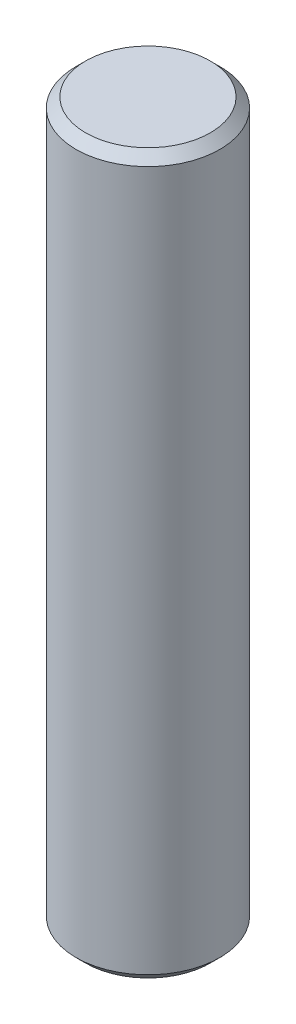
ISO-10303-21;
HEADER;
FILE_DESCRIPTION(('STEP AP214'),'2;1');
FILE_NAME('part.step','',(''),(''),'','','');
FILE_SCHEMA(('AUTOMOTIVE_DESIGN { 1 0 10303 214 1 1 1 1 }'));
ENDSEC;
DATA;
#1=APPLICATION_CONTEXT('core data for automotive mechanical design processes');
#2=APPLICATION_PROTOCOL_DEFINITION('international standard','automotive_design',2000,#1);
#3=PRODUCT_CONTEXT('',#1,'mechanical');
#4=PRODUCT('Part','Part','',(#3));
#5=PRODUCT_RELATED_PRODUCT_CATEGORY('part','',(#4));
#6=PRODUCT_DEFINITION_FORMATION('','',#4);
#7=PRODUCT_DEFINITION_CONTEXT('part definition',#1,'design');
#8=PRODUCT_DEFINITION('design','',#6,#7);
#9=PRODUCT_DEFINITION_SHAPE('','',#8);
#10=(LENGTH_UNIT() NAMED_UNIT(*) SI_UNIT(.MILLI.,.METRE.));
#11=(NAMED_UNIT(*) PLANE_ANGLE_UNIT() SI_UNIT($,.RADIAN.));
#12=(NAMED_UNIT(*) SI_UNIT($,.STERADIAN.) SOLID_ANGLE_UNIT());
#13=UNCERTAINTY_MEASURE_WITH_UNIT(LENGTH_MEASURE(1.E-05),#10,'distance_accuracy_value','');
#14=(GEOMETRIC_REPRESENTATION_CONTEXT(3) GLOBAL_UNCERTAINTY_ASSIGNED_CONTEXT((#13)) GLOBAL_UNIT_ASSIGNED_CONTEXT((#10,
#11,#12)) REPRESENTATION_CONTEXT('',''));
#15=CARTESIAN_POINT('',(0.,0.,0.));
#16=DIRECTION('',(0.,0.,1.));
#17=DIRECTION('',(1.,0.,0.));
#18=AXIS2_PLACEMENT_3D('',#15,#16,#17);
#19=CARTESIAN_POINT('',(0.,15.,0.));
#20=DIRECTION('',(0.,-1.,0.));
#21=DIRECTION('',(0.,0.,-1.));
#22=AXIS2_PLACEMENT_3D('',#19,#20,#21);
#23=CYLINDRICAL_SURFACE('',#22,1.5);
#24=CARTESIAN_POINT('',(0.,0.199999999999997,0.));
#25=DIRECTION('',(0.,1.,0.));
#26=DIRECTION('',(0.,0.,1.));
#27=AXIS2_PLACEMENT_3D('',#24,#25,#26);
#28=CIRCLE('',#27,1.5);
#29=CARTESIAN_POINT('',(0.,0.199999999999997,1.5));
#30=VERTEX_POINT('',#29);
#31=EDGE_CURVE('E41',#30,#30,#28,.T.);
#32=ORIENTED_EDGE('',*,*,#31,.T.);
#33=EDGE_LOOP('',(#32));
#34=FACE_BOUND('',#33,.T.);
#35=CARTESIAN_POINT('',(0.,14.8,0.));
#36=DIRECTION('',(0.,1.,0.));
#37=DIRECTION('',(0.,0.,1.));
#38=AXIS2_PLACEMENT_3D('',#35,#36,#37);
#39=CIRCLE('',#38,1.5);
#40=CARTESIAN_POINT('',(0.,14.8,1.5));
#41=VERTEX_POINT('',#40);
#42=EDGE_CURVE('E45',#41,#41,#39,.F.);
#43=ORIENTED_EDGE('',*,*,#42,.T.);
#44=EDGE_LOOP('',(#43));
#45=FACE_BOUND('',#44,.T.);
#46=ADVANCED_FACE('F30',(#34,#45),#23,.T.);
#47=CARTESIAN_POINT('',(0.,15.,0.));
#48=DIRECTION('',(0.,1.,0.));
#49=DIRECTION('',(0.,0.,1.));
#50=AXIS2_PLACEMENT_3D('',#47,#48,#49);
#51=PLANE('',#50);
#52=CARTESIAN_POINT('',(0.,15.,0.));
#53=DIRECTION('',(0.,1.,0.));
#54=DIRECTION('',(0.,0.,1.));
#55=AXIS2_PLACEMENT_3D('',#52,#53,#54);
#56=CIRCLE('',#55,1.3);
#57=CARTESIAN_POINT('',(0.,15.,1.3));
#58=VERTEX_POINT('',#57);
#59=EDGE_CURVE('E10',#58,#58,#56,.T.);
#60=ORIENTED_EDGE('',*,*,#59,.T.);
#61=EDGE_LOOP('',(#60));
#62=FACE_BOUND('',#61,.T.);
#63=ADVANCED_FACE('F61',(#62),#51,.T.);
#64=CARTESIAN_POINT('',(0.,0.,0.));
#65=DIRECTION('',(0.,1.,0.));
#66=DIRECTION('',(0.,0.,1.));
#67=AXIS2_PLACEMENT_3D('',#64,#65,#66);
#68=PLANE('',#67);
#69=CARTESIAN_POINT('',(0.,0.,0.));
#70=DIRECTION('',(0.,1.,0.));
#71=DIRECTION('',(0.,0.,1.));
#72=AXIS2_PLACEMENT_3D('',#69,#70,#71);
#73=CIRCLE('',#72,1.3);
#74=CARTESIAN_POINT('',(0.,0.,1.3));
#75=VERTEX_POINT('',#74);
#76=EDGE_CURVE('E37',#75,#75,#73,.F.);
#77=ORIENTED_EDGE('',*,*,#76,.T.);
#78=EDGE_LOOP('',(#77));
#79=FACE_BOUND('',#78,.T.);
#80=ADVANCED_FACE('F58',(#79),#68,.F.);
#81=CARTESIAN_POINT('',(0.,0.199999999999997,0.));
#82=DIRECTION('',(0.,1.,0.));
#83=DIRECTION('',(0.,0.,1.));
#84=AXIS2_PLACEMENT_3D('',#81,#82,#83);
#85=CONICAL_SURFACE('',#84,1.5,0.785398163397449);
#86=ORIENTED_EDGE('',*,*,#76,.F.);
#87=EDGE_LOOP('',(#86));
#88=FACE_BOUND('',#87,.T.);
#89=ORIENTED_EDGE('',*,*,#31,.F.);
#90=EDGE_LOOP('',(#89));
#91=FACE_BOUND('',#90,.T.);
#92=ADVANCED_FACE('F54',(#88,#91),#85,.T.);
#93=CARTESIAN_POINT('',(0.,15.,0.));
#94=DIRECTION('',(0.,-1.,0.));
#95=DIRECTION('',(0.,0.,-1.));
#96=AXIS2_PLACEMENT_3D('',#93,#94,#95);
#97=CONICAL_SURFACE('',#96,1.3,0.785398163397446);
#98=ORIENTED_EDGE('',*,*,#42,.F.);
#99=EDGE_LOOP('',(#98));
#100=FACE_BOUND('',#99,.T.);
#101=ORIENTED_EDGE('',*,*,#59,.F.);
#102=EDGE_LOOP('',(#101));
#103=FACE_BOUND('',#102,.T.);
#104=ADVANCED_FACE('F32',(#100,#103),#97,.T.);
#105=CLOSED_SHELL('',(#46,#63,#80,#92,#104));
#106=MANIFOLD_SOLID_BREP('B2',#105);
#107=ADVANCED_BREP_SHAPE_REPRESENTATION('',(#18,#106),#14);
#108=SHAPE_DEFINITION_REPRESENTATION(#9,#107);
ENDSEC;
END-ISO-10303-21;
